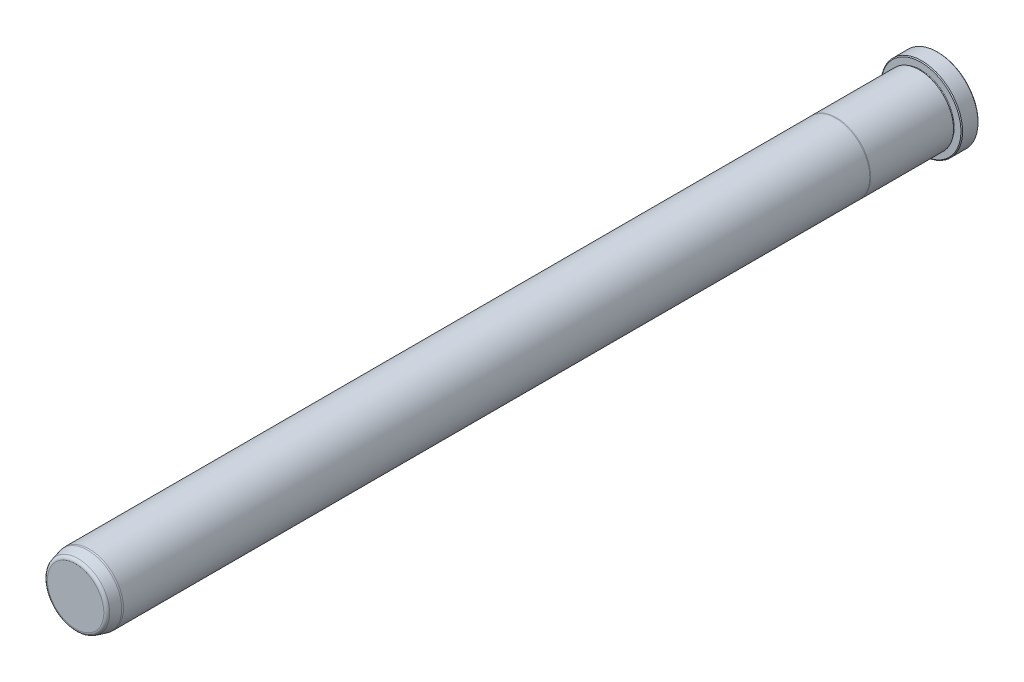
ISO-10303-21;
HEADER;
FILE_DESCRIPTION(('STEP AP214'),'2;1');
FILE_NAME('part.step','',(''),(''),'','','');
FILE_SCHEMA(('AUTOMOTIVE_DESIGN { 1 0 10303 214 1 1 1 1 }'));
ENDSEC;
DATA;
#1=APPLICATION_CONTEXT('core data for automotive mechanical design processes');
#2=APPLICATION_PROTOCOL_DEFINITION('international standard','automotive_design',2000,#1);
#3=PRODUCT_CONTEXT('',#1,'mechanical');
#4=PRODUCT('Part','Part','',(#3));
#5=PRODUCT_RELATED_PRODUCT_CATEGORY('part','',(#4));
#6=PRODUCT_DEFINITION_FORMATION('','',#4);
#7=PRODUCT_DEFINITION_CONTEXT('part definition',#1,'design');
#8=PRODUCT_DEFINITION('design','',#6,#7);
#9=PRODUCT_DEFINITION_SHAPE('','',#8);
#10=(LENGTH_UNIT() NAMED_UNIT(*) SI_UNIT(.MILLI.,.METRE.));
#11=(NAMED_UNIT(*) PLANE_ANGLE_UNIT() SI_UNIT($,.RADIAN.));
#12=(NAMED_UNIT(*) SI_UNIT($,.STERADIAN.) SOLID_ANGLE_UNIT());
#13=UNCERTAINTY_MEASURE_WITH_UNIT(LENGTH_MEASURE(1.E-05),#10,'distance_accuracy_value','');
#14=(GEOMETRIC_REPRESENTATION_CONTEXT(3) GLOBAL_UNCERTAINTY_ASSIGNED_CONTEXT((#13)) GLOBAL_UNIT_ASSIGNED_CONTEXT((#10,
#11,#12)) REPRESENTATION_CONTEXT('',''));
#15=CARTESIAN_POINT('',(0.,0.,0.));
#16=DIRECTION('',(0.,0.,1.));
#17=DIRECTION('',(1.,0.,0.));
#18=AXIS2_PLACEMENT_3D('',#15,#16,#17);
#19=CARTESIAN_POINT('',(0.,0.,0.));
#20=DIRECTION('',(0.,0.,1.));
#21=DIRECTION('',(1.,0.,0.));
#22=AXIS2_PLACEMENT_3D('',#19,#20,#21);
#23=PLANE('',#22);
#24=CARTESIAN_POINT('',(0.,0.,0.));
#25=DIRECTION('',(0.,0.,1.));
#26=DIRECTION('',(1.,0.,0.));
#27=AXIS2_PLACEMENT_3D('',#24,#25,#26);
#28=CIRCLE('',#27,18.5419999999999);
#29=CARTESIAN_POINT('',(18.5419999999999,0.,0.));
#30=VERTEX_POINT('',#29);
#31=EDGE_CURVE('E37',#30,#30,#28,.F.);
#32=ORIENTED_EDGE('',*,*,#31,.T.);
#33=EDGE_LOOP('',(#32));
#34=FACE_BOUND('',#33,.T.);
#35=ADVANCED_FACE('F30',(#34),#23,.F.);
#36=CARTESIAN_POINT('',(0.,0.,0.));
#37=DIRECTION('',(0.,0.,1.));
#38=DIRECTION('',(1.,0.,0.));
#39=AXIS2_PLACEMENT_3D('',#36,#37,#38);
#40=CYLINDRICAL_SURFACE('',#39,18.923);
#41=CARTESIAN_POINT('',(0.,0.,0.381000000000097));
#42=DIRECTION('',(0.,0.,1.));
#43=DIRECTION('',(1.,0.,0.));
#44=AXIS2_PLACEMENT_3D('',#41,#42,#43);
#45=CIRCLE('',#44,18.923);
#46=CARTESIAN_POINT('',(18.923,0.,0.381000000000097));
#47=VERTEX_POINT('',#46);
#48=EDGE_CURVE('E41',#47,#47,#45,.T.);
#49=ORIENTED_EDGE('',*,*,#48,.T.);
#50=EDGE_LOOP('',(#49));
#51=FACE_BOUND('',#50,.T.);
#52=CARTESIAN_POINT('',(0.,0.,7.54380000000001));
#53=DIRECTION('',(0.,0.,-1.));
#54=DIRECTION('',(-1.,0.,0.));
#55=AXIS2_PLACEMENT_3D('',#52,#53,#54);
#56=CIRCLE('',#55,18.923);
#57=CARTESIAN_POINT('',(-18.923,0.,7.54380000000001));
#58=VERTEX_POINT('',#57);
#59=EDGE_CURVE('E45',#58,#58,#56,.T.);
#60=ORIENTED_EDGE('',*,*,#59,.T.);
#61=EDGE_LOOP('',(#60));
#62=FACE_BOUND('',#61,.T.);
#63=ADVANCED_FACE('F118',(#51,#62),#40,.T.);
#64=CARTESIAN_POINT('',(0.,18.923,7.9248));
#65=DIRECTION('',(0.,0.,-1.));
#66=DIRECTION('',(-1.,0.,0.));
#67=AXIS2_PLACEMENT_3D('',#64,#65,#66);
#68=PLANE('',#67);
#69=CARTESIAN_POINT('',(0.,0.,7.9248));
#70=DIRECTION('',(0.,0.,-1.));
#71=DIRECTION('',(-1.,0.,0.));
#72=AXIS2_PLACEMENT_3D('',#69,#70,#71);
#73=CIRCLE('',#72,18.542);
#74=CARTESIAN_POINT('',(-18.542,0.,7.9248));
#75=VERTEX_POINT('',#74);
#76=EDGE_CURVE('E10',#75,#75,#73,.F.);
#77=ORIENTED_EDGE('',*,*,#76,.T.);
#78=EDGE_LOOP('',(#77));
#79=FACE_BOUND('',#78,.T.);
#80=CARTESIAN_POINT('',(0.,0.,7.9248));
#81=DIRECTION('',(0.,0.,1.));
#82=DIRECTION('',(1.,0.,0.));
#83=AXIS2_PLACEMENT_3D('',#80,#81,#82);
#84=CIRCLE('',#83,15.4813);
#85=CARTESIAN_POINT('',(15.4813,0.,7.9248));
#86=VERTEX_POINT('',#85);
#87=EDGE_CURVE('E56',#86,#86,#84,.T.);
#88=ORIENTED_EDGE('',*,*,#87,.F.);
#89=EDGE_LOOP('',(#88));
#90=FACE_BOUND('',#89,.T.);
#91=ADVANCED_FACE('F113',(#79,#90),#68,.F.);
#92=CARTESIAN_POINT('',(0.,0.,8.3058));
#93=DIRECTION('',(0.,0.,1.));
#94=DIRECTION('',(1.,0.,0.));
#95=AXIS2_PLACEMENT_3D('',#92,#93,#94);
#96=TOROIDAL_SURFACE('',#95,15.4813,0.381000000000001);
#97=CARTESIAN_POINT('',(0.,0.,8.6868));
#98=DIRECTION('',(0.,0.,1.));
#99=DIRECTION('',(1.,0.,0.));
#100=AXIS2_PLACEMENT_3D('',#97,#98,#99);
#101=CIRCLE('',#100,15.4813);
#102=CARTESIAN_POINT('',(15.4813,0.,8.6868));
#103=VERTEX_POINT('',#102);
#104=EDGE_CURVE('E59',#103,#103,#101,.T.);
#105=ORIENTED_EDGE('',*,*,#104,.F.);
#106=EDGE_LOOP('',(#105));
#107=FACE_BOUND('',#106,.T.);
#108=ORIENTED_EDGE('',*,*,#87,.T.);
#109=EDGE_LOOP('',(#108));
#110=FACE_BOUND('',#109,.T.);
#111=ADVANCED_FACE('F107',(#107,#110),#96,.F.);
#112=CARTESIAN_POINT('',(0.,15.4813,8.6868));
#113=DIRECTION('',(0.,0.,1.));
#114=DIRECTION('',(1.,0.,0.));
#115=AXIS2_PLACEMENT_3D('',#112,#113,#114);
#116=PLANE('',#115);
#117=CARTESIAN_POINT('',(0.,0.,8.6868));
#118=DIRECTION('',(0.,0.,1.));
#119=DIRECTION('',(1.,0.,0.));
#120=AXIS2_PLACEMENT_3D('',#117,#118,#119);
#121=CIRCLE('',#120,15.8877);
#122=CARTESIAN_POINT('',(15.8877,0.,8.6868));
#123=VERTEX_POINT('',#122);
#124=EDGE_CURVE('E62',#123,#123,#121,.T.);
#125=ORIENTED_EDGE('',*,*,#124,.F.);
#126=EDGE_LOOP('',(#125));
#127=FACE_BOUND('',#126,.T.);
#128=ORIENTED_EDGE('',*,*,#104,.T.);
#129=EDGE_LOOP('',(#128));
#130=FACE_BOUND('',#129,.T.);
#131=ADVANCED_FACE('F101',(#127,#130),#116,.F.);
#132=CARTESIAN_POINT('',(0.,0.,0.));
#133=DIRECTION('',(0.,0.,1.));
#134=DIRECTION('',(1.,0.,0.));
#135=AXIS2_PLACEMENT_3D('',#132,#133,#134);
#136=CYLINDRICAL_SURFACE('',#135,15.8877);
#137=CARTESIAN_POINT('',(0.,0.,47.1347630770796));
#138=DIRECTION('',(0.,0.,1.));
#139=DIRECTION('',(1.,0.,0.));
#140=AXIS2_PLACEMENT_3D('',#137,#138,#139);
#141=CIRCLE('',#140,15.8877);
#142=CARTESIAN_POINT('',(15.8877,0.,47.1347630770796));
#143=VERTEX_POINT('',#142);
#144=EDGE_CURVE('E65',#143,#143,#141,.T.);
#145=ORIENTED_EDGE('',*,*,#144,.F.);
#146=EDGE_LOOP('',(#145));
#147=FACE_BOUND('',#146,.T.);
#148=ORIENTED_EDGE('',*,*,#124,.T.);
#149=EDGE_LOOP('',(#148));
#150=FACE_BOUND('',#149,.T.);
#151=ADVANCED_FACE('F95',(#147,#150),#136,.T.);
#152=CARTESIAN_POINT('',(0.,0.,47.1347630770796));
#153=DIRECTION('',(0.,0.,-1.));
#154=DIRECTION('',(-1.,0.,0.));
#155=AXIS2_PLACEMENT_3D('',#152,#153,#154);
#156=CONICAL_SURFACE('',#155,15.8877,0.0698131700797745);
#157=CARTESIAN_POINT('',(0.,0.,47.498));
#158=DIRECTION('',(0.,0.,1.));
#159=DIRECTION('',(1.,0.,0.));
#160=AXIS2_PLACEMENT_3D('',#157,#158,#159);
#161=CIRCLE('',#160,15.8623);
#162=CARTESIAN_POINT('',(15.8623,0.,47.498));
#163=VERTEX_POINT('',#162);
#164=EDGE_CURVE('E68',#163,#163,#161,.T.);
#165=ORIENTED_EDGE('',*,*,#164,.F.);
#166=EDGE_LOOP('',(#165));
#167=FACE_BOUND('',#166,.T.);
#168=ORIENTED_EDGE('',*,*,#144,.T.);
#169=EDGE_LOOP('',(#168));
#170=FACE_BOUND('',#169,.T.);
#171=ADVANCED_FACE('F89',(#167,#170),#156,.T.);
#172=CARTESIAN_POINT('',(0.,0.,0.));
#173=DIRECTION('',(0.,0.,1.));
#174=DIRECTION('',(1.,0.,0.));
#175=AXIS2_PLACEMENT_3D('',#172,#173,#174);
#176=CYLINDRICAL_SURFACE('',#175,15.8623);
#177=CARTESIAN_POINT('',(0.,0.,393.7));
#178=DIRECTION('',(0.,0.,1.));
#179=DIRECTION('',(1.,0.,0.));
#180=AXIS2_PLACEMENT_3D('',#177,#178,#179);
#181=CIRCLE('',#180,15.8623);
#182=CARTESIAN_POINT('',(15.8623,0.,393.7));
#183=VERTEX_POINT('',#182);
#184=EDGE_CURVE('E71',#183,#183,#181,.T.);
#185=ORIENTED_EDGE('',*,*,#184,.F.);
#186=EDGE_LOOP('',(#185));
#187=FACE_BOUND('',#186,.T.);
#188=ORIENTED_EDGE('',*,*,#164,.T.);
#189=EDGE_LOOP('',(#188));
#190=FACE_BOUND('',#189,.T.);
#191=ADVANCED_FACE('F83',(#187,#190),#176,.T.);
#192=CARTESIAN_POINT('',(0.,0.,393.7));
#193=DIRECTION('',(0.,0.,-1.));
#194=DIRECTION('',(-1.,0.,0.));
#195=AXIS2_PLACEMENT_3D('',#192,#193,#194);
#196=CONICAL_SURFACE('',#195,15.8623,0.0872664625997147);
#197=CARTESIAN_POINT('',(0.,0.,394.462));
#198=DIRECTION('',(0.,0.,1.));
#199=DIRECTION('',(1.,0.,0.));
#200=AXIS2_PLACEMENT_3D('',#197,#198,#199);
#201=CIRCLE('',#200,15.7956336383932);
#202=CARTESIAN_POINT('',(15.7956336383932,0.,394.462));
#203=VERTEX_POINT('',#202);
#204=EDGE_CURVE('E74',#203,#203,#201,.T.);
#205=ORIENTED_EDGE('',*,*,#204,.F.);
#206=EDGE_LOOP('',(#205));
#207=FACE_BOUND('',#206,.T.);
#208=ORIENTED_EDGE('',*,*,#184,.T.);
#209=EDGE_LOOP('',(#208));
#210=FACE_BOUND('',#209,.T.);
#211=ADVANCED_FACE('F80',(#207,#210),#196,.T.);
#212=CARTESIAN_POINT('',(0.,0.,394.462));
#213=DIRECTION('',(0.,0.,-1.));
#214=DIRECTION('',(-1.,0.,0.));
#215=AXIS2_PLACEMENT_3D('',#212,#213,#214);
#216=CONICAL_SURFACE('',#215,15.7956336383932,0.261799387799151);
#217=CARTESIAN_POINT('',(0.,0.,398.8733752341));
#218=DIRECTION('',(0.,0.,1.));
#219=DIRECTION('',(1.,0.,0.));
#220=AXIS2_PLACEMENT_3D('',#217,#218,#219);
#221=CIRCLE('',#220,14.6136092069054);
#222=CARTESIAN_POINT('',(14.6136092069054,0.,398.8733752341));
#223=VERTEX_POINT('',#222);
#224=EDGE_CURVE('E50',#223,#223,#221,.F.);
#225=ORIENTED_EDGE('',*,*,#224,.T.);
#226=EDGE_LOOP('',(#225));
#227=FACE_BOUND('',#226,.T.);
#228=ORIENTED_EDGE('',*,*,#204,.T.);
#229=EDGE_LOOP('',(#228));
#230=FACE_BOUND('',#229,.T.);
#231=ADVANCED_FACE('F78',(#227,#230),#216,.T.);
#232=CARTESIAN_POINT('',(0.,14.2983335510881,400.05));
#233=DIRECTION('',(0.,0.,-1.));
#234=DIRECTION('',(-1.,0.,0.));
#235=AXIS2_PLACEMENT_3D('',#232,#233,#234);
#236=PLANE('',#235);
#237=CARTESIAN_POINT('',(0.,0.,400.05));
#238=DIRECTION('',(0.,0.,-1.));
#239=DIRECTION('',(-1.,0.,0.));
#240=AXIS2_PLACEMENT_3D('',#237,#238,#239);
#241=CIRCLE('',#240,13.0802019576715);
#242=CARTESIAN_POINT('',(-13.0802019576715,0.,400.05));
#243=VERTEX_POINT('',#242);
#244=EDGE_CURVE('E53',#243,#243,#241,.F.);
#245=ORIENTED_EDGE('',*,*,#244,.T.);
#246=EDGE_LOOP('',(#245));
#247=FACE_BOUND('',#246,.T.);
#248=ADVANCED_FACE('F133',(#247),#236,.F.);
#249=CARTESIAN_POINT('',(0.,0.,398.4625));
#250=DIRECTION('',(0.,0.,-1.));
#251=DIRECTION('',(-1.,0.,0.));
#252=AXIS2_PLACEMENT_3D('',#249,#250,#251);
#253=TOROIDAL_SURFACE('',#252,13.0802019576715,1.5875);
#254=ORIENTED_EDGE('',*,*,#224,.F.);
#255=EDGE_LOOP('',(#254));
#256=FACE_BOUND('',#255,.T.);
#257=ORIENTED_EDGE('',*,*,#244,.F.);
#258=EDGE_LOOP('',(#257));
#259=FACE_BOUND('',#258,.T.);
#260=ADVANCED_FACE('F130',(#256,#259),#253,.T.);
#261=CARTESIAN_POINT('',(0.,0.,0.381000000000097));
#262=DIRECTION('',(0.,0.,1.));
#263=DIRECTION('',(1.,0.,0.));
#264=AXIS2_PLACEMENT_3D('',#261,#262,#263);
#265=CONICAL_SURFACE('',#264,18.923,0.785398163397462);
#266=ORIENTED_EDGE('',*,*,#31,.F.);
#267=EDGE_LOOP('',(#266));
#268=FACE_BOUND('',#267,.T.);
#269=ORIENTED_EDGE('',*,*,#48,.F.);
#270=EDGE_LOOP('',(#269));
#271=FACE_BOUND('',#270,.T.);
#272=ADVANCED_FACE('F132',(#268,#271),#265,.T.);
#273=CARTESIAN_POINT('',(0.,0.,7.9248));
#274=DIRECTION('',(0.,0.,-1.));
#275=DIRECTION('',(-1.,0.,0.));
#276=AXIS2_PLACEMENT_3D('',#273,#274,#275);
#277=CONICAL_SURFACE('',#276,18.542,0.785398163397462);
#278=ORIENTED_EDGE('',*,*,#59,.F.);
#279=EDGE_LOOP('',(#278));
#280=FACE_BOUND('',#279,.T.);
#281=ORIENTED_EDGE('',*,*,#76,.F.);
#282=EDGE_LOOP('',(#281));
#283=FACE_BOUND('',#282,.T.);
#284=ADVANCED_FACE('F32',(#280,#283),#277,.T.);
#285=CLOSED_SHELL('',(#35,#63,#91,#111,#131,#151,#171,#191,#211,#231,#248,#260,#272,#284));
#286=MANIFOLD_SOLID_BREP('B2',#285);
#287=ADVANCED_BREP_SHAPE_REPRESENTATION('',(#18,#286),#14);
#288=SHAPE_DEFINITION_REPRESENTATION(#9,#287);
ENDSEC;
END-ISO-10303-21;
